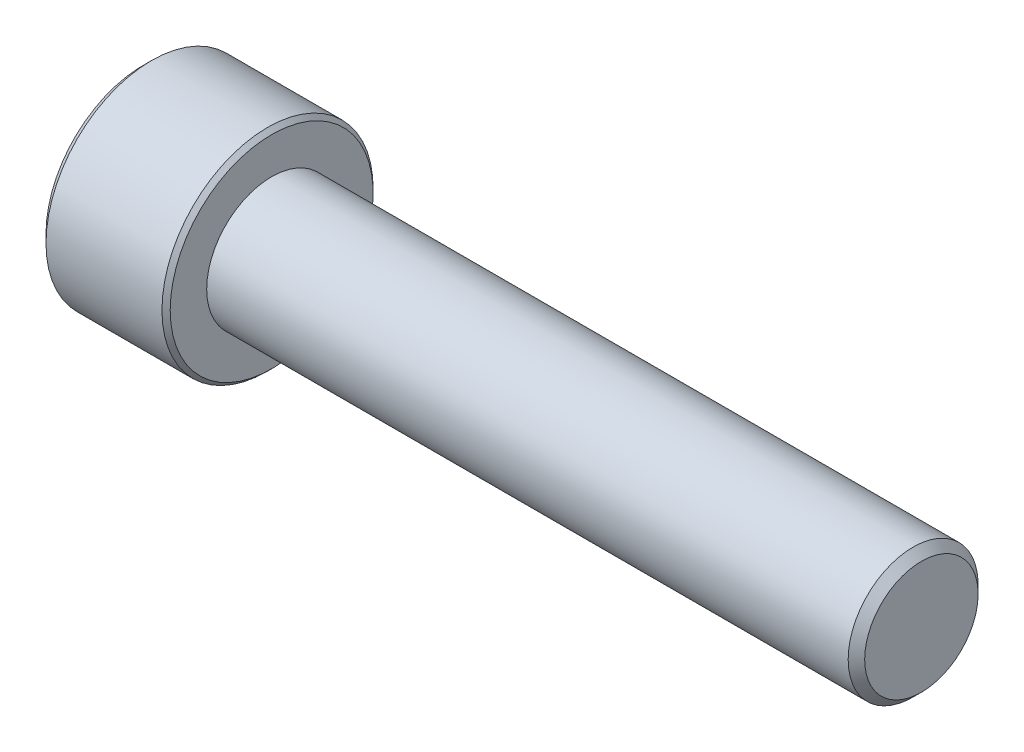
ISO-10303-21;
HEADER;
FILE_DESCRIPTION(('STEP AP214'),'2;1');
FILE_NAME('part.step','',(''),(''),'','','');
FILE_SCHEMA(('AUTOMOTIVE_DESIGN { 1 0 10303 214 1 1 1 1 }'));
ENDSEC;
DATA;
#1=APPLICATION_CONTEXT('core data for automotive mechanical design processes');
#2=APPLICATION_PROTOCOL_DEFINITION('international standard','automotive_design',2000,#1);
#3=PRODUCT_CONTEXT('',#1,'mechanical');
#4=PRODUCT('Part','Part','',(#3));
#5=PRODUCT_RELATED_PRODUCT_CATEGORY('part','',(#4));
#6=PRODUCT_DEFINITION_FORMATION('','',#4);
#7=PRODUCT_DEFINITION_CONTEXT('part definition',#1,'design');
#8=PRODUCT_DEFINITION('design','',#6,#7);
#9=PRODUCT_DEFINITION_SHAPE('','',#8);
#10=(LENGTH_UNIT() NAMED_UNIT(*) SI_UNIT(.MILLI.,.METRE.));
#11=(NAMED_UNIT(*) PLANE_ANGLE_UNIT() SI_UNIT($,.RADIAN.));
#12=(NAMED_UNIT(*) SI_UNIT($,.STERADIAN.) SOLID_ANGLE_UNIT());
#13=UNCERTAINTY_MEASURE_WITH_UNIT(LENGTH_MEASURE(1.E-05),#10,'distance_accuracy_value','');
#14=(GEOMETRIC_REPRESENTATION_CONTEXT(3) GLOBAL_UNCERTAINTY_ASSIGNED_CONTEXT((#13)) GLOBAL_UNIT_ASSIGNED_CONTEXT((#10,
#11,#12)) REPRESENTATION_CONTEXT('',''));
#15=CARTESIAN_POINT('',(0.,0.,0.));
#16=DIRECTION('',(0.,0.,1.));
#17=DIRECTION('',(1.,0.,0.));
#18=AXIS2_PLACEMENT_3D('',#15,#16,#17);
#19=CARTESIAN_POINT('',(-7.9,6.5,0.));
#20=DIRECTION('',(1.,0.,0.));
#21=DIRECTION('',(0.,0.,-1.));
#22=AXIS2_PLACEMENT_3D('',#19,#20,#21);
#23=PLANE('',#22);
#24=CARTESIAN_POINT('',(-7.9,0.,0.));
#25=DIRECTION('',(1.,0.,0.));
#26=DIRECTION('',(0.,0.,-1.));
#27=AXIS2_PLACEMENT_3D('',#24,#25,#26);
#28=CIRCLE('',#27,5.992);
#29=CARTESIAN_POINT('',(-7.9,0.,-5.992));
#30=VERTEX_POINT('',#29);
#31=EDGE_CURVE('E149',#30,#30,#28,.F.);
#32=ORIENTED_EDGE('',*,*,#31,.T.);
#33=EDGE_LOOP('',(#32));
#34=FACE_BOUND('',#33,.T.);
#35=DIRECTION('',(0.,0.,1.));
#36=VECTOR('',#35,1.);
#37=CARTESIAN_POINT('',(-7.9,-3.,-1.73205080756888));
#38=LINE('',#37,#36);
#39=CARTESIAN_POINT('',(-7.9,-3.,-1.73205080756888));
#40=VERTEX_POINT('',#39);
#41=CARTESIAN_POINT('',(-7.9,-3.,1.73205080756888));
#42=VERTEX_POINT('',#41);
#43=EDGE_CURVE('E122',#40,#42,#38,.T.);
#44=ORIENTED_EDGE('',*,*,#43,.F.);
#45=DIRECTION('',(0.,-0.866025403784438,0.5));
#46=VECTOR('',#45,1.);
#47=CARTESIAN_POINT('',(-7.9,0.,-3.46410161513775));
#48=LINE('',#47,#46);
#49=CARTESIAN_POINT('',(-7.9,0.,-3.46410161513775));
#50=VERTEX_POINT('',#49);
#51=EDGE_CURVE('E48',#50,#40,#48,.T.);
#52=ORIENTED_EDGE('',*,*,#51,.F.);
#53=DIRECTION('',(0.,-0.866025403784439,-0.5));
#54=VECTOR('',#53,1.);
#55=CARTESIAN_POINT('',(-7.9,3.,-1.73205080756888));
#56=LINE('',#55,#54);
#57=CARTESIAN_POINT('',(-7.9,3.,-1.73205080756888));
#58=VERTEX_POINT('',#57);
#59=EDGE_CURVE('E131',#58,#50,#56,.T.);
#60=ORIENTED_EDGE('',*,*,#59,.F.);
#61=DIRECTION('',(0.,0.,-1.));
#62=VECTOR('',#61,1.);
#63=CARTESIAN_POINT('',(-7.9,3.,1.73205080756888));
#64=LINE('',#63,#62);
#65=CARTESIAN_POINT('',(-7.9,3.,1.73205080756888));
#66=VERTEX_POINT('',#65);
#67=EDGE_CURVE('E129',#66,#58,#64,.T.);
#68=ORIENTED_EDGE('',*,*,#67,.F.);
#69=DIRECTION('',(0.,0.866025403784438,-0.5));
#70=VECTOR('',#69,1.);
#71=CARTESIAN_POINT('',(-7.9,0.,3.46410161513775));
#72=LINE('',#71,#70);
#73=CARTESIAN_POINT('',(-7.9,0.,3.46410161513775));
#74=VERTEX_POINT('',#73);
#75=EDGE_CURVE('E96',#74,#66,#72,.T.);
#76=ORIENTED_EDGE('',*,*,#75,.F.);
#77=DIRECTION('',(0.,0.866025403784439,0.5));
#78=VECTOR('',#77,1.);
#79=CARTESIAN_POINT('',(-7.9,-3.,1.73205080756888));
#80=LINE('',#79,#78);
#81=EDGE_CURVE('E125',#42,#74,#80,.T.);
#82=ORIENTED_EDGE('',*,*,#81,.F.);
#83=EDGE_LOOP('',(#44,#52,#60,#68,#76,#82));
#84=FACE_BOUND('',#83,.T.);
#85=ADVANCED_FACE('F33',(#34,#84),#23,.F.);
#86=CARTESIAN_POINT('',(40.,0.,0.));
#87=DIRECTION('',(-1.,0.,0.));
#88=DIRECTION('',(0.,0.,1.));
#89=AXIS2_PLACEMENT_3D('',#86,#87,#88);
#90=PLANE('',#89);
#91=CARTESIAN_POINT('',(40.,0.,0.));
#92=DIRECTION('',(-1.,0.,0.));
#93=DIRECTION('',(0.,0.,1.));
#94=AXIS2_PLACEMENT_3D('',#91,#92,#93);
#95=CIRCLE('',#94,3.49200000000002);
#96=CARTESIAN_POINT('',(40.,0.,3.49200000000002));
#97=VERTEX_POINT('',#96);
#98=EDGE_CURVE('E146',#97,#97,#95,.F.);
#99=ORIENTED_EDGE('',*,*,#98,.T.);
#100=EDGE_LOOP('',(#99));
#101=FACE_BOUND('',#100,.T.);
#102=ADVANCED_FACE('F170',(#101),#90,.F.);
#103=CARTESIAN_POINT('',(-7.9,0.,0.));
#104=DIRECTION('',(-1.,0.,0.));
#105=DIRECTION('',(0.,0.,1.));
#106=AXIS2_PLACEMENT_3D('',#103,#104,#105);
#107=CYLINDRICAL_SURFACE('',#106,4.);
#108=CARTESIAN_POINT('',(39.492,0.,0.));
#109=DIRECTION('',(-1.,0.,0.));
#110=DIRECTION('',(0.,0.,1.));
#111=AXIS2_PLACEMENT_3D('',#108,#109,#110);
#112=CIRCLE('',#111,4.);
#113=CARTESIAN_POINT('',(39.492,0.,4.));
#114=VERTEX_POINT('',#113);
#115=EDGE_CURVE('E143',#114,#114,#112,.T.);
#116=ORIENTED_EDGE('',*,*,#115,.T.);
#117=EDGE_LOOP('',(#116));
#118=FACE_BOUND('',#117,.T.);
#119=CARTESIAN_POINT('',(0.,0.,0.));
#120=DIRECTION('',(-1.,0.,0.));
#121=DIRECTION('',(0.,0.,1.));
#122=AXIS2_PLACEMENT_3D('',#119,#120,#121);
#123=CIRCLE('',#122,4.);
#124=CARTESIAN_POINT('',(0.,0.,4.));
#125=VERTEX_POINT('',#124);
#126=EDGE_CURVE('E135',#125,#125,#123,.T.);
#127=ORIENTED_EDGE('',*,*,#126,.F.);
#128=EDGE_LOOP('',(#127));
#129=FACE_BOUND('',#128,.T.);
#130=ADVANCED_FACE('F176',(#118,#129),#107,.T.);
#131=CARTESIAN_POINT('',(0.,4.,0.));
#132=DIRECTION('',(-1.,0.,0.));
#133=DIRECTION('',(0.,0.,1.));
#134=AXIS2_PLACEMENT_3D('',#131,#132,#133);
#135=PLANE('',#134);
#136=CARTESIAN_POINT('',(0.,0.,0.));
#137=DIRECTION('',(-1.,0.,0.));
#138=DIRECTION('',(0.,0.,1.));
#139=AXIS2_PLACEMENT_3D('',#136,#137,#138);
#140=CIRCLE('',#139,6.24600000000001);
#141=CARTESIAN_POINT('',(0.,0.,6.24600000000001));
#142=VERTEX_POINT('',#141);
#143=EDGE_CURVE('E11',#142,#142,#140,.F.);
#144=ORIENTED_EDGE('',*,*,#143,.T.);
#145=EDGE_LOOP('',(#144));
#146=FACE_BOUND('',#145,.T.);
#147=ORIENTED_EDGE('',*,*,#126,.T.);
#148=EDGE_LOOP('',(#147));
#149=FACE_BOUND('',#148,.T.);
#150=ADVANCED_FACE('F195',(#146,#149),#135,.F.);
#151=CARTESIAN_POINT('',(-7.9,0.,0.));
#152=DIRECTION('',(-1.,0.,0.));
#153=DIRECTION('',(0.,0.,1.));
#154=AXIS2_PLACEMENT_3D('',#151,#152,#153);
#155=CYLINDRICAL_SURFACE('',#154,6.5);
#156=CARTESIAN_POINT('',(-0.253999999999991,0.,0.));
#157=DIRECTION('',(-1.,0.,0.));
#158=DIRECTION('',(0.,0.,1.));
#159=AXIS2_PLACEMENT_3D('',#156,#157,#158);
#160=CIRCLE('',#159,6.5);
#161=CARTESIAN_POINT('',(-0.253999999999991,0.,6.5));
#162=VERTEX_POINT('',#161);
#163=EDGE_CURVE('E41',#162,#162,#160,.T.);
#164=ORIENTED_EDGE('',*,*,#163,.T.);
#165=EDGE_LOOP('',(#164));
#166=FACE_BOUND('',#165,.T.);
#167=CARTESIAN_POINT('',(-7.392,0.,0.));
#168=DIRECTION('',(1.,0.,0.));
#169=DIRECTION('',(0.,0.,-1.));
#170=AXIS2_PLACEMENT_3D('',#167,#168,#169);
#171=CIRCLE('',#170,6.5);
#172=CARTESIAN_POINT('',(-7.392,0.,-6.5));
#173=VERTEX_POINT('',#172);
#174=EDGE_CURVE('E152',#173,#173,#171,.T.);
#175=ORIENTED_EDGE('',*,*,#174,.T.);
#176=EDGE_LOOP('',(#175));
#177=FACE_BOUND('',#176,.T.);
#178=ADVANCED_FACE('F157',(#166,#177),#155,.T.);
#179=CARTESIAN_POINT('',(-4.344,0.,-3.46410161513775));
#180=DIRECTION('',(0.,-0.5,-0.866025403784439));
#181=DIRECTION('',(0.,0.866025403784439,-0.5));
#182=AXIS2_PLACEMENT_3D('',#179,#180,#181);
#183=PLANE('',#182);
#184=ORIENTED_EDGE('',*,*,#51,.T.);
#185=DIRECTION('',(-1.,0.,0.));
#186=VECTOR('',#185,1.);
#187=CARTESIAN_POINT('',(-4.344,-3.,-1.73205080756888));
#188=LINE('',#187,#186);
#189=CARTESIAN_POINT('',(-4.344,-3.,-1.73205080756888));
#190=VERTEX_POINT('',#189);
#191=EDGE_CURVE('E78',#190,#40,#188,.T.);
#192=ORIENTED_EDGE('',*,*,#191,.F.);
#193=DIRECTION('',(0.,-0.866025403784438,0.5));
#194=VECTOR('',#193,1.);
#195=CARTESIAN_POINT('',(-4.344,0.,-3.46410161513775));
#196=LINE('',#195,#194);
#197=CARTESIAN_POINT('',(-4.344,0.,-3.46410161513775));
#198=VERTEX_POINT('',#197);
#199=EDGE_CURVE('E133',#198,#190,#196,.T.);
#200=ORIENTED_EDGE('',*,*,#199,.F.);
#201=DIRECTION('',(-1.,0.,0.));
#202=VECTOR('',#201,1.);
#203=CARTESIAN_POINT('',(-4.344,0.,-3.46410161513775));
#204=LINE('',#203,#202);
#205=EDGE_CURVE('E56',#198,#50,#204,.T.);
#206=ORIENTED_EDGE('',*,*,#205,.T.);
#207=EDGE_LOOP('',(#184,#192,#200,#206));
#208=FACE_BOUND('',#207,.T.);
#209=ADVANCED_FACE('F204',(#208),#183,.F.);
#210=CARTESIAN_POINT('',(-4.344,3.,-1.73205080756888));
#211=DIRECTION('',(0.,0.5,-0.866025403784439));
#212=DIRECTION('',(0.,0.866025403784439,0.5));
#213=AXIS2_PLACEMENT_3D('',#210,#211,#212);
#214=PLANE('',#213);
#215=ORIENTED_EDGE('',*,*,#59,.T.);
#216=ORIENTED_EDGE('',*,*,#205,.F.);
#217=DIRECTION('',(0.,-0.866025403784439,-0.5));
#218=VECTOR('',#217,1.);
#219=CARTESIAN_POINT('',(-4.344,3.,-1.73205080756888));
#220=LINE('',#219,#218);
#221=CARTESIAN_POINT('',(-4.344,3.,-1.73205080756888));
#222=VERTEX_POINT('',#221);
#223=EDGE_CURVE('E108',#222,#198,#220,.T.);
#224=ORIENTED_EDGE('',*,*,#223,.F.);
#225=DIRECTION('',(-1.,0.,0.));
#226=VECTOR('',#225,1.);
#227=CARTESIAN_POINT('',(-4.344,3.,-1.73205080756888));
#228=LINE('',#227,#226);
#229=EDGE_CURVE('E100',#222,#58,#228,.T.);
#230=ORIENTED_EDGE('',*,*,#229,.T.);
#231=EDGE_LOOP('',(#215,#216,#224,#230));
#232=FACE_BOUND('',#231,.T.);
#233=ADVANCED_FACE('F209',(#232),#214,.F.);
#234=CARTESIAN_POINT('',(-4.344,3.,1.73205080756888));
#235=DIRECTION('',(0.,1.,0.));
#236=DIRECTION('',(0.,0.,1.));
#237=AXIS2_PLACEMENT_3D('',#234,#235,#236);
#238=PLANE('',#237);
#239=ORIENTED_EDGE('',*,*,#67,.T.);
#240=ORIENTED_EDGE('',*,*,#229,.F.);
#241=DIRECTION('',(0.,0.,-1.));
#242=VECTOR('',#241,1.);
#243=CARTESIAN_POINT('',(-4.344,3.,1.73205080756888));
#244=LINE('',#243,#242);
#245=CARTESIAN_POINT('',(-4.344,3.,1.73205080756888));
#246=VERTEX_POINT('',#245);
#247=EDGE_CURVE('E104',#246,#222,#244,.T.);
#248=ORIENTED_EDGE('',*,*,#247,.F.);
#249=DIRECTION('',(-1.,0.,0.));
#250=VECTOR('',#249,1.);
#251=CARTESIAN_POINT('',(-4.344,3.,1.73205080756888));
#252=LINE('',#251,#250);
#253=EDGE_CURVE('E89',#246,#66,#252,.T.);
#254=ORIENTED_EDGE('',*,*,#253,.T.);
#255=EDGE_LOOP('',(#239,#240,#248,#254));
#256=FACE_BOUND('',#255,.T.);
#257=ADVANCED_FACE('F105',(#256),#238,.F.);
#258=CARTESIAN_POINT('',(-4.344,0.,3.46410161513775));
#259=DIRECTION('',(0.,0.5,0.866025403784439));
#260=DIRECTION('',(0.,-0.866025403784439,0.5));
#261=AXIS2_PLACEMENT_3D('',#258,#259,#260);
#262=PLANE('',#261);
#263=ORIENTED_EDGE('',*,*,#75,.T.);
#264=ORIENTED_EDGE('',*,*,#253,.F.);
#265=DIRECTION('',(0.,0.866025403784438,-0.5));
#266=VECTOR('',#265,1.);
#267=CARTESIAN_POINT('',(-4.344,0.,3.46410161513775));
#268=LINE('',#267,#266);
#269=CARTESIAN_POINT('',(-4.344,0.,3.46410161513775));
#270=VERTEX_POINT('',#269);
#271=EDGE_CURVE('E93',#270,#246,#268,.T.);
#272=ORIENTED_EDGE('',*,*,#271,.F.);
#273=DIRECTION('',(-1.,0.,0.));
#274=VECTOR('',#273,1.);
#275=CARTESIAN_POINT('',(-4.344,0.,3.46410161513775));
#276=LINE('',#275,#274);
#277=EDGE_CURVE('E101',#270,#74,#276,.T.);
#278=ORIENTED_EDGE('',*,*,#277,.T.);
#279=EDGE_LOOP('',(#263,#264,#272,#278));
#280=FACE_BOUND('',#279,.T.);
#281=ADVANCED_FACE('F91',(#280),#262,.F.);
#282=CARTESIAN_POINT('',(-4.344,-3.,1.73205080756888));
#283=DIRECTION('',(0.,-0.5,0.866025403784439));
#284=DIRECTION('',(0.,-0.866025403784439,-0.5));
#285=AXIS2_PLACEMENT_3D('',#282,#283,#284);
#286=PLANE('',#285);
#287=ORIENTED_EDGE('',*,*,#81,.T.);
#288=ORIENTED_EDGE('',*,*,#277,.F.);
#289=DIRECTION('',(0.,0.866025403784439,0.5));
#290=VECTOR('',#289,1.);
#291=CARTESIAN_POINT('',(-4.344,-3.,1.73205080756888));
#292=LINE('',#291,#290);
#293=CARTESIAN_POINT('',(-4.344,-3.,1.73205080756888));
#294=VERTEX_POINT('',#293);
#295=EDGE_CURVE('E114',#294,#270,#292,.T.);
#296=ORIENTED_EDGE('',*,*,#295,.F.);
#297=DIRECTION('',(-1.,0.,0.));
#298=VECTOR('',#297,1.);
#299=CARTESIAN_POINT('',(-4.344,-3.,1.73205080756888));
#300=LINE('',#299,#298);
#301=EDGE_CURVE('E138',#294,#42,#300,.T.);
#302=ORIENTED_EDGE('',*,*,#301,.T.);
#303=EDGE_LOOP('',(#287,#288,#296,#302));
#304=FACE_BOUND('',#303,.T.);
#305=ADVANCED_FACE('F212',(#304),#286,.F.);
#306=CARTESIAN_POINT('',(-4.344,-3.,-1.73205080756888));
#307=DIRECTION('',(0.,-1.,0.));
#308=DIRECTION('',(0.,0.,-1.));
#309=AXIS2_PLACEMENT_3D('',#306,#307,#308);
#310=PLANE('',#309);
#311=ORIENTED_EDGE('',*,*,#43,.T.);
#312=ORIENTED_EDGE('',*,*,#301,.F.);
#313=DIRECTION('',(0.,0.,1.));
#314=VECTOR('',#313,1.);
#315=CARTESIAN_POINT('',(-4.344,-3.,-1.73205080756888));
#316=LINE('',#315,#314);
#317=EDGE_CURVE('E116',#190,#294,#316,.T.);
#318=ORIENTED_EDGE('',*,*,#317,.F.);
#319=ORIENTED_EDGE('',*,*,#191,.T.);
#320=EDGE_LOOP('',(#311,#312,#318,#319));
#321=FACE_BOUND('',#320,.T.);
#322=ADVANCED_FACE('F187',(#321),#310,.F.);
#323=CARTESIAN_POINT('',(-4.344,0.,0.));
#324=DIRECTION('',(-1.,0.,0.));
#325=DIRECTION('',(0.,0.,1.));
#326=AXIS2_PLACEMENT_3D('',#323,#324,#325);
#327=PLANE('',#326);
#328=ORIENTED_EDGE('',*,*,#199,.T.);
#329=ORIENTED_EDGE('',*,*,#317,.T.);
#330=ORIENTED_EDGE('',*,*,#295,.T.);
#331=ORIENTED_EDGE('',*,*,#271,.T.);
#332=ORIENTED_EDGE('',*,*,#247,.T.);
#333=ORIENTED_EDGE('',*,*,#223,.T.);
#334=EDGE_LOOP('',(#328,#329,#330,#331,#332,#333));
#335=FACE_BOUND('',#334,.T.);
#336=ADVANCED_FACE('F111',(#335),#327,.T.);
#337=CARTESIAN_POINT('',(39.492,0.,0.));
#338=DIRECTION('',(-1.,0.,0.));
#339=DIRECTION('',(0.,0.,1.));
#340=AXIS2_PLACEMENT_3D('',#337,#338,#339);
#341=CONICAL_SURFACE('',#340,4.,0.785398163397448);
#342=ORIENTED_EDGE('',*,*,#98,.F.);
#343=EDGE_LOOP('',(#342));
#344=FACE_BOUND('',#343,.T.);
#345=ORIENTED_EDGE('',*,*,#115,.F.);
#346=EDGE_LOOP('',(#345));
#347=FACE_BOUND('',#346,.T.);
#348=ADVANCED_FACE('F166',(#344,#347),#341,.T.);
#349=CARTESIAN_POINT('',(-7.9,0.,0.));
#350=DIRECTION('',(1.,0.,0.));
#351=DIRECTION('',(0.,0.,-1.));
#352=AXIS2_PLACEMENT_3D('',#349,#350,#351);
#353=CONICAL_SURFACE('',#352,5.992,0.785398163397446);
#354=ORIENTED_EDGE('',*,*,#174,.F.);
#355=EDGE_LOOP('',(#354));
#356=FACE_BOUND('',#355,.T.);
#357=ORIENTED_EDGE('',*,*,#31,.F.);
#358=EDGE_LOOP('',(#357));
#359=FACE_BOUND('',#358,.T.);
#360=ADVANCED_FACE('F161',(#356,#359),#353,.T.);
#361=CARTESIAN_POINT('',(-0.253999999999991,0.,0.));
#362=DIRECTION('',(-1.,0.,0.));
#363=DIRECTION('',(0.,0.,1.));
#364=AXIS2_PLACEMENT_3D('',#361,#362,#363);
#365=CONICAL_SURFACE('',#364,6.5,0.78539816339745);
#366=ORIENTED_EDGE('',*,*,#143,.F.);
#367=EDGE_LOOP('',(#366));
#368=FACE_BOUND('',#367,.T.);
#369=ORIENTED_EDGE('',*,*,#163,.F.);
#370=EDGE_LOOP('',(#369));
#371=FACE_BOUND('',#370,.T.);
#372=ADVANCED_FACE('F35',(#368,#371),#365,.T.);
#373=CLOSED_SHELL('',(#85,#102,#130,#150,#178,#209,#233,#257,#281,#305,#322,#336,#348,#360,#372));
#374=MANIFOLD_SOLID_BREP('B2',#373);
#375=ADVANCED_BREP_SHAPE_REPRESENTATION('',(#18,#374),#14);
#376=SHAPE_DEFINITION_REPRESENTATION(#9,#375);
ENDSEC;
END-ISO-10303-21;
